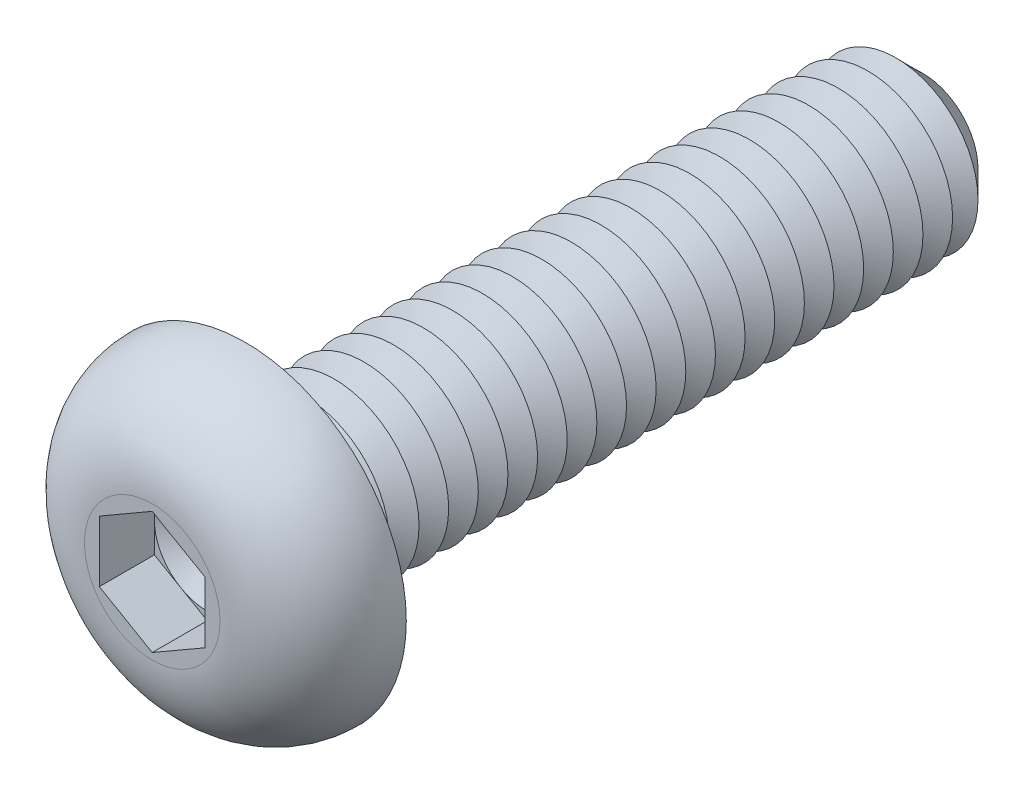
from build123d import *

# Parameters (mm, degrees)
CUT_EXTRUDE1_DEPTH  = 1.3
SKETCH4_R           = 2
BOSS_EXTRUDE1_DEPTH = 16
CHAMFER1_SIZE       = 0.7
LPATTERN1_COUNT     = 21
LPATTERN1_PITCH     = 0.7
FILLET2_R           = 0.3


with BuildPart() as part:
    # Sketch2 → Revolve1 (revolve)
    with BuildSketch(Plane(origin=(0, 0, 0), x_dir=(0, 0, -1), z_dir=(1, 0, 0)), mode=Mode.PRIVATE) as revolve1_sk:
        with BuildLine():
            Line((0, 0), (-2.2, 0))
            Line((-2.2, 0), (-2.2, 1.6))
            ThreePointArc((-2.2, 1.6), (-1.555634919, 3.155634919), (0, 3.8))
            Line((0, 3.8), (0, 0))
        make_face()
    revolve(revolve1_sk.sketch.rotate(Axis((0, 0, 47.934239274), (0, 0, -1)), 90), axis=Axis((0, 0, 47.934239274), (0, 0, -1)))

    # Sketch3 → Cut-Extrude1 (cut)
    with BuildSketch(Plane.XY.offset(2.2)):
        Polygon((0, 1.443375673), (-1.25, 0.721687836), (-1.25, -0.721687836), (0, -1.443375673), (1.25, -0.721687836), (1.25, 0.721687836), align=None)
    extrude(amount=-CUT_EXTRUDE1_DEPTH, mode=Mode.SUBTRACT)

    # Sketch4 → Boss-Extrude1 (add)
    with BuildSketch(Plane(origin=(0, 0, 0), x_dir=(-1, 0, 0), z_dir=(0, 0, -1))):
        with Locations(Location((0, 0, 0), (0, 0, 180))):
            Circle(SKETCH4_R)
    extrude(amount=BOSS_EXTRUDE1_DEPTH)

    # Chamfer1
    chamfer1_edges = [part.edges().sort_by_distance(p)[0] for p in [
        (-2, 0, -16),
    ]]
    chamfer(chamfer1_edges, length=CHAMFER1_SIZE)

    # Sketch5 → Cut-Revolve1 (revolve, cut)
    with BuildSketch(Plane(origin=(0, 0, 0), x_dir=(0, 0, -1), z_dir=(1, 0, 0)), mode=Mode.PRIVATE) as cut_revolve1_sk:
        Polygon((0.7, 2), (1.4, 2), (1.05, 1.393782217), align=None)
    cut_revolve1 = revolve(cut_revolve1_sk.sketch.rotate(Axis((0, 0, 47.934239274), (0, 0, -1)), 90), axis=Axis((0, 0, 47.934239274), (0, 0, -1)), mode=Mode.SUBTRACT)

    # LPattern1: Cut-Revolve1 ×21
    with Locations(*[(0, 0, -i * LPATTERN1_PITCH) for i in range(1, LPATTERN1_COUNT)]):
        add(cut_revolve1, mode=Mode.SUBTRACT)

    # Fillet2
    fillet2_edges = [part.edges().sort_by_distance(p)[0] for p in [
        (-2, 0, 0),
    ]]
    fillet(fillet2_edges, radius=FILLET2_R)

    # Cut-Extrude2 cone 1 section (on through the dimple's axis) → Cut-Extrude2 (revolve, cut)
    with BuildSketch(Plane(origin=(0, 0, 0.9), x_dir=(0, -1, 0), z_dir=(1, 0, 0))):
        Polygon((0, 0), (1.25, 0), (0, 0.721687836), align=None)
    revolve(axis=Axis((0, 0, 0.9), (0, 0, -1)), mode=Mode.SUBTRACT)


solid = part.part
